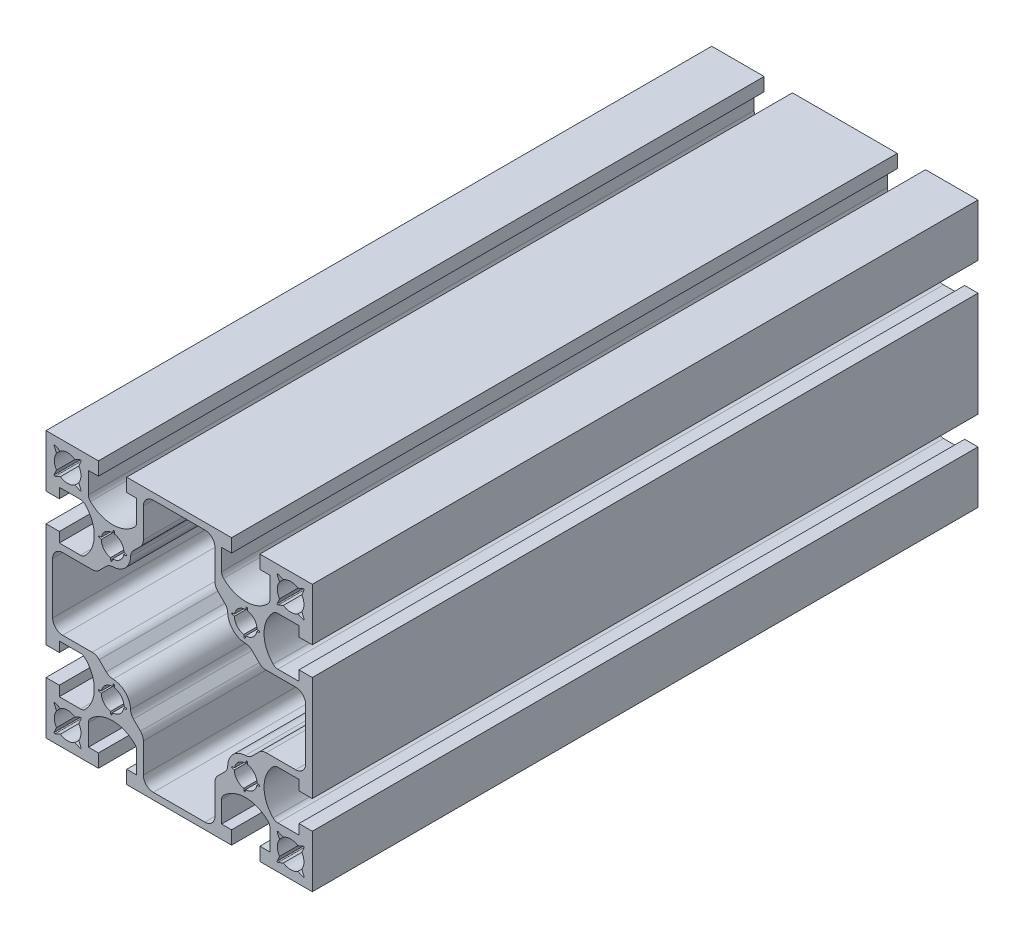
from build123d import *

# Parameters (mm, degrees)
SKETCH_1_W          = 80
SKETCH_1_H          = 80
EXTRUDE_1_DEPTH     = 100
SKETCH_2_R          = 4
SKETCH_2_R_2        = 3.4
CUT_EXTRUDE_1_DEPTH = 208.846096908
CUT_EXTRUDE_2_DEPTH = 208.846096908
CUT_EXTRUDE_3_DEPTH = 208.846096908
CUT_EXTRUDE_4_DEPTH = 208.846096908
CUT_EXTRUDE_5_DEPTH = 208.846096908


with BuildPart() as part:
    # Sketch 1 → Extrude 1 (new, symmetric)
    with BuildSketch(Plane.XY):
        Rectangle(SKETCH_1_W, SKETCH_1_H)
    extrude(amount=EXTRUDE_1_DEPTH, both=True)

    # Sketch 2 → Cut-Extrude 1 (cut, through all)
    with BuildSketch(Plane.XY.offset(100)):
        with Locations((-33.5, -33.5)):
            Circle(SKETCH_2_R)
        with Locations((-20, -20)):
            Circle(SKETCH_2_R_2)
        with Locations(Location((33.5, -33.5, 0), (0, 0, 180))):
            Circle(SKETCH_2_R)
        with Locations(Location((20, -20, 0), (0, 0, 180))):
            Circle(SKETCH_2_R_2)
        with Locations((33.5, 33.5)):
            Circle(SKETCH_2_R)
        with Locations((20, 20)):
            Circle(SKETCH_2_R_2)
        with Locations(Location((-20, 20, 0), (0, 0, 180))):
            Circle(SKETCH_2_R_2)
        with Locations(Location((-33.5, 33.5, 0), (0, 0, 180))):
            Circle(SKETCH_2_R)
    extrude(amount=-CUT_EXTRUDE_1_DEPTH, mode=Mode.SUBTRACT)

    # Sketch 3 → Cut-Extrude 2 (cut, through all)
    with BuildSketch(Plane.XY.offset(100)):
        with BuildLine():
            Line((-40, -15.75), (-40, -24.25))
            Line((-40, -24.25), (-36, -24.25))
            Line((-36, -24.25), (-36, -27.25))
            Line((-36, -27.25), (-29.643928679, -27.25))
            ThreePointArc((-29.643928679, -27.25), (-28.869332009, -27.093908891), (-28.215642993, -26.65))
            ThreePointArc((-28.215642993, -26.65), (-25.5, -20), (-28.215642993, -13.35))
            ThreePointArc((-28.215642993, -13.35), (-28.869332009, -12.906091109), (-29.643928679, -12.75))
            Line((-29.643928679, -12.75), (-36, -12.75))
            Line((-36, -12.75), (-36, -15.75))
            Line((-36, -15.75), (-40, -15.75))
        make_face()
        with BuildLine():
            Line((-12.75, -36), (-12.75, -29.643928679))
            ThreePointArc((-12.75, -29.643928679), (-12.906091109, -28.869332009), (-13.35, -28.215642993))
            ThreePointArc((-13.35, -28.215642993), (-20, -25.5), (-26.65, -28.215642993))
            ThreePointArc((-26.65, -28.215642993), (-27.093908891, -28.869332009), (-27.25, -29.643928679))
            Line((-27.25, -29.643928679), (-27.25, -36))
            Line((-27.25, -36), (-24.25, -36))
            Line((-24.25, -36), (-24.25, -40))
            Line((-24.25, -40), (-15.75, -40))
            Line((-15.75, -40), (-15.75, -36))
            Line((-15.75, -36), (-12.75, -36))
        make_face()
        with BuildLine():
            Line((-15.75, 40), (-24.25, 40))
            Line((-24.25, 40), (-24.25, 36))
            Line((-24.25, 36), (-27.25, 36))
            Line((-27.25, 36), (-27.25, 29.643928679))
            ThreePointArc((-27.25, 29.643928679), (-27.093908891, 28.869332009), (-26.65, 28.215642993))
            ThreePointArc((-26.65, 28.215642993), (-20, 25.5), (-13.35, 28.215642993))
            ThreePointArc((-13.35, 28.215642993), (-12.906091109, 28.869332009), (-12.75, 29.643928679))
            Line((-12.75, 29.643928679), (-12.75, 36))
            Line((-12.75, 36), (-15.75, 36))
            Line((-15.75, 36), (-15.75, 40))
        make_face()
        with BuildLine():
            Line((-36, 12.75), (-29.643928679, 12.75))
            ThreePointArc((-29.643928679, 12.75), (-28.869332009, 12.906091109), (-28.215642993, 13.35))
            ThreePointArc((-28.215642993, 13.35), (-25.5, 20), (-28.215642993, 26.65))
            ThreePointArc((-28.215642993, 26.65), (-28.869332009, 27.093908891), (-29.643928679, 27.25))
            Line((-29.643928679, 27.25), (-36, 27.25))
            Line((-36, 27.25), (-36, 24.25))
            Line((-36, 24.25), (-40, 24.25))
            Line((-40, 24.25), (-40, 15.75))
            Line((-40, 15.75), (-36, 15.75))
            Line((-36, 15.75), (-36, 12.75))
        make_face()
        with BuildLine():
            Line((40, 15.75), (40, 24.25))
            Line((40, 24.25), (36, 24.25))
            Line((36, 24.25), (36, 27.25))
            Line((36, 27.25), (29.643928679, 27.25))
            ThreePointArc((29.643928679, 27.25), (28.869332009, 27.093908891), (28.215642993, 26.65))
            ThreePointArc((28.215642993, 26.65), (25.5, 20), (28.215642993, 13.35))
            ThreePointArc((28.215642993, 13.35), (28.869332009, 12.906091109), (29.643928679, 12.75))
            Line((29.643928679, 12.75), (36, 12.75))
            Line((36, 12.75), (36, 15.75))
            Line((36, 15.75), (40, 15.75))
        make_face()
        with BuildLine():
            Line((12.75, 36), (12.75, 29.643928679))
            ThreePointArc((12.75, 29.643928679), (12.906091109, 28.869332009), (13.35, 28.215642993))
            ThreePointArc((13.35, 28.215642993), (20, 25.5), (26.65, 28.215642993))
            ThreePointArc((26.65, 28.215642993), (27.093908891, 28.869332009), (27.25, 29.643928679))
            Line((27.25, 29.643928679), (27.25, 36))
            Line((27.25, 36), (24.25, 36))
            Line((24.25, 36), (24.25, 40))
            Line((24.25, 40), (15.75, 40))
            Line((15.75, 40), (15.75, 36))
            Line((15.75, 36), (12.75, 36))
        make_face()
        with BuildLine():
            Line((15.75, -40), (24.25, -40))
            Line((24.25, -40), (24.25, -36))
            Line((24.25, -36), (27.25, -36))
            Line((27.25, -36), (27.25, -29.643928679))
            ThreePointArc((27.25, -29.643928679), (27.093908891, -28.869332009), (26.65, -28.215642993))
            ThreePointArc((26.65, -28.215642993), (20, -25.5), (13.35, -28.215642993))
            ThreePointArc((13.35, -28.215642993), (12.906091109, -28.869332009), (12.75, -29.643928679))
            Line((12.75, -29.643928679), (12.75, -36))
            Line((12.75, -36), (15.75, -36))
            Line((15.75, -36), (15.75, -40))
        make_face()
        with BuildLine():
            Line((36, -12.75), (29.643928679, -12.75))
            ThreePointArc((29.643928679, -12.75), (28.869332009, -12.906091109), (28.215642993, -13.35))
            ThreePointArc((28.215642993, -13.35), (25.5, -20), (28.215642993, -26.65))
            ThreePointArc((28.215642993, -26.65), (28.869332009, -27.093908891), (29.643928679, -27.25))
            Line((29.643928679, -27.25), (36, -27.25))
            Line((36, -27.25), (36, -24.25))
            Line((36, -24.25), (40, -24.25))
            Line((40, -24.25), (40, -15.75))
            Line((40, -15.75), (36, -15.75))
            Line((36, -15.75), (36, -12.75))
        make_face()
    extrude(amount=-CUT_EXTRUDE_2_DEPTH, mode=Mode.SUBTRACT)

    # Sketch 4 → Cut-Extrude 3 (cut, through all)
    with BuildSketch(Plane.XY.offset(100)):
        with BuildLine():
            Line((-38, 0), (-38, 7.75))
            ThreePointArc((-38, 7.75), (-37.121320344, 9.871320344), (-35, 10.75))
            Line((-35, 10.75), (-26.132912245, 10.75))
            ThreePointArc((-26.132912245, 10.75), (-24.984861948, 10.978361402), (-24.011591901, 11.628679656))
            Line((-24.011591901, 11.628679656), (-21.91645258, 13.723818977))
            ThreePointArc((-21.91645258, 13.723818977), (-20.976898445, 14.359930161), (-19.868299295, 14.601606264))
            ThreePointArc((-19.868299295, 14.601606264), (-16.181623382, 16.181623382), (-14.601606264, 19.868299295))
            ThreePointArc((-14.601606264, 19.868299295), (-14.359930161, 20.976898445), (-13.723818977, 21.91645258))
            Line((-13.723818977, 21.91645258), (-11.628679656, 24.011591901))
            ThreePointArc((-11.628679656, 24.011591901), (-10.978361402, 24.984861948), (-10.75, 26.132912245))
            Line((-10.75, 26.132912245), (-10.75, 35))
            ThreePointArc((-10.75, 35), (-9.871320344, 37.121320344), (-7.75, 38))
            Line((-7.75, 38), (0, 38))
            Line((0, 38), (7.75, 38))
            ThreePointArc((7.75, 38), (9.871320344, 37.121320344), (10.75, 35))
            Line((10.75, 35), (10.75, 26.132912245))
            ThreePointArc((10.75, 26.132912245), (10.978361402, 24.984861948), (11.628679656, 24.011591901))
            Line((11.628679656, 24.011591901), (13.723818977, 21.91645258))
            ThreePointArc((13.723818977, 21.91645258), (14.359930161, 20.976898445), (14.601606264, 19.868299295))
            ThreePointArc((14.601606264, 19.868299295), (16.181623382, 16.181623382), (19.868299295, 14.601606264))
            ThreePointArc((19.868299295, 14.601606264), (20.976898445, 14.359930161), (21.91645258, 13.723818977))
            Line((21.91645258, 13.723818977), (24.011591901, 11.628679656))
            ThreePointArc((24.011591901, 11.628679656), (24.984861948, 10.978361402), (26.132912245, 10.75))
            Line((26.132912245, 10.75), (35, 10.75))
            ThreePointArc((35, 10.75), (37.121320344, 9.871320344), (38, 7.75))
            Line((38, 7.75), (38, 0))
            Line((38, 0), (38, -7.75))
            ThreePointArc((38, -7.75), (37.121320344, -9.871320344), (35, -10.75))
            Line((35, -10.75), (26.132912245, -10.75))
            ThreePointArc((26.132912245, -10.75), (24.984861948, -10.978361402), (24.011591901, -11.628679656))
            Line((24.011591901, -11.628679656), (21.91645258, -13.723818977))
            ThreePointArc((21.91645258, -13.723818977), (20.976898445, -14.359930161), (19.868299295, -14.601606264))
            ThreePointArc((19.868299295, -14.601606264), (16.181623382, -16.181623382), (14.601606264, -19.868299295))
            ThreePointArc((14.601606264, -19.868299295), (14.359930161, -20.976898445), (13.723818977, -21.91645258))
            Line((13.723818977, -21.91645258), (11.628679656, -24.011591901))
            ThreePointArc((11.628679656, -24.011591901), (10.978361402, -24.984861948), (10.75, -26.132912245))
            Line((10.75, -26.132912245), (10.75, -35))
            ThreePointArc((10.75, -35), (9.871320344, -37.121320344), (7.75, -38))
            Line((7.75, -38), (0, -38))
            Line((0, -38), (-7.75, -38))
            ThreePointArc((-7.75, -38), (-9.871320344, -37.121320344), (-10.75, -35))
            Line((-10.75, -35), (-10.75, -26.132912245))
            ThreePointArc((-10.75, -26.132912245), (-10.978361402, -24.984861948), (-11.628679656, -24.011591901))
            Line((-11.628679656, -24.011591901), (-13.723818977, -21.91645258))
            ThreePointArc((-13.723818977, -21.91645258), (-14.359930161, -20.976898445), (-14.601606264, -19.868299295))
            ThreePointArc((-14.601606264, -19.868299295), (-16.181623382, -16.181623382), (-19.868299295, -14.601606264))
            ThreePointArc((-19.868299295, -14.601606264), (-20.976898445, -14.359930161), (-21.91645258, -13.723818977))
            Line((-21.91645258, -13.723818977), (-24.011591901, -11.628679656))
            ThreePointArc((-24.011591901, -11.628679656), (-24.984861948, -10.978361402), (-26.132912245, -10.75))
            Line((-26.132912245, -10.75), (-35, -10.75))
            ThreePointArc((-35, -10.75), (-37.121320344, -9.871320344), (-38, -7.75))
            Line((-38, -7.75), (-38, 0))
        make_face()
    extrude(amount=-CUT_EXTRUDE_3_DEPTH, mode=Mode.SUBTRACT)

    # Sketch 5 → Cut-Extrude 4 (cut, through all)
    with BuildSketch(Plane.XY.offset(100)):
        with BuildLine():
            Line((-16.6, -20), (-15.942283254, -20.156380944))
            ThreePointArc((-15.942283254, -20.156380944), (-15.789307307, -20.368387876), (-15.976773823, -20.550609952))
            Line((-15.976773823, -20.550609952), (-16.65165364, -20.590403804))
            ThreePointArc((-16.65165364, -20.590403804), (-16.612938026, -20.296329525), (-16.6, -20))
        make_face()
        with BuildLine():
            Line((-20, -23.4), (-20.156380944, -24.057716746))
            ThreePointArc((-20.156380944, -24.057716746), (-20.368387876, -24.210692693), (-20.550609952, -24.023226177))
            Line((-20.550609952, -24.023226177), (-20.590403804, -23.34834636))
            ThreePointArc((-20.590403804, -23.34834636), (-20.296329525, -23.387061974), (-20, -23.4))
        make_face()
        with BuildLine():
            Line((-23.4, -20), (-24.057716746, -19.843619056))
            ThreePointArc((-24.057716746, -19.843619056), (-24.210692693, -19.631612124), (-24.023226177, -19.449390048))
            Line((-24.023226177, -19.449390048), (-23.34834636, -19.409596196))
            ThreePointArc((-23.34834636, -19.409596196), (-23.387061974, -19.703670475), (-23.4, -20))
        make_face()
        with BuildLine():
            Line((-20, -16.6), (-19.843619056, -15.942283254))
            ThreePointArc((-19.843619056, -15.942283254), (-19.631612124, -15.789307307), (-19.449390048, -15.976773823))
            Line((-19.449390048, -15.976773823), (-19.409596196, -16.65165364))
            ThreePointArc((-19.409596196, -16.65165364), (-19.703670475, -16.612938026), (-20, -16.6))
        make_face()
        with BuildLine():
            Line((-20, 16.6), (-20.156380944, 15.942283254))
            ThreePointArc((-20.156380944, 15.942283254), (-20.368387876, 15.789307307), (-20.550609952, 15.976773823))
            Line((-20.550609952, 15.976773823), (-20.590403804, 16.65165364))
            ThreePointArc((-20.590403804, 16.65165364), (-20.296329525, 16.612938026), (-20, 16.6))
        make_face()
        with BuildLine():
            Line((-23.4, 20), (-24.057716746, 20.156380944))
            ThreePointArc((-24.057716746, 20.156380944), (-24.210692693, 20.368387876), (-24.023226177, 20.550609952))
            Line((-24.023226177, 20.550609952), (-23.34834636, 20.590403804))
            ThreePointArc((-23.34834636, 20.590403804), (-23.387061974, 20.296329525), (-23.4, 20))
        make_face()
        with BuildLine():
            Line((-20, 23.4), (-19.843619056, 24.057716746))
            ThreePointArc((-19.843619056, 24.057716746), (-19.631612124, 24.210692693), (-19.449390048, 24.023226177))
            Line((-19.449390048, 24.023226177), (-19.409596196, 23.34834636))
            ThreePointArc((-19.409596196, 23.34834636), (-19.703670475, 23.387061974), (-20, 23.4))
        make_face()
        with BuildLine():
            Line((-16.6, 20), (-15.942283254, 19.843619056))
            ThreePointArc((-15.942283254, 19.843619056), (-15.789307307, 19.631612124), (-15.976773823, 19.449390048))
            Line((-15.976773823, 19.449390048), (-16.65165364, 19.409596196))
            ThreePointArc((-16.65165364, 19.409596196), (-16.612938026, 19.703670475), (-16.6, 20))
        make_face()
        with BuildLine():
            Line((16.6, 20), (15.942283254, 20.156380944))
            ThreePointArc((15.942283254, 20.156380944), (15.789307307, 20.368387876), (15.976773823, 20.550609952))
            Line((15.976773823, 20.550609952), (16.65165364, 20.590403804))
            ThreePointArc((16.65165364, 20.590403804), (16.612938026, 20.296329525), (16.6, 20))
        make_face()
        with BuildLine():
            Line((20, 23.4), (20.156380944, 24.057716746))
            ThreePointArc((20.156380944, 24.057716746), (20.368387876, 24.210692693), (20.550609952, 24.023226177))
            Line((20.550609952, 24.023226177), (20.590403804, 23.34834636))
            ThreePointArc((20.590403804, 23.34834636), (20.296329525, 23.387061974), (20, 23.4))
        make_face()
        with BuildLine():
            Line((23.4, 20), (24.057716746, 19.843619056))
            ThreePointArc((24.057716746, 19.843619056), (24.210692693, 19.631612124), (24.023226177, 19.449390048))
            Line((24.023226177, 19.449390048), (23.34834636, 19.409596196))
            ThreePointArc((23.34834636, 19.409596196), (23.387061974, 19.703670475), (23.4, 20))
        make_face()
        with BuildLine():
            Line((20, 16.6), (19.843619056, 15.942283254))
            ThreePointArc((19.843619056, 15.942283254), (19.631612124, 15.789307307), (19.449390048, 15.976773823))
            Line((19.449390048, 15.976773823), (19.409596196, 16.65165364))
            ThreePointArc((19.409596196, 16.65165364), (19.703670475, 16.612938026), (20, 16.6))
        make_face()
        with BuildLine():
            Line((20, -16.6), (20.156380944, -15.942283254))
            ThreePointArc((20.156380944, -15.942283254), (20.368387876, -15.789307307), (20.550609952, -15.976773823))
            Line((20.550609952, -15.976773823), (20.590403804, -16.65165364))
            ThreePointArc((20.590403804, -16.65165364), (20.296329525, -16.612938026), (20, -16.6))
        make_face()
        with BuildLine():
            Line((23.4, -20), (24.057716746, -20.156380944))
            ThreePointArc((24.057716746, -20.156380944), (24.210692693, -20.368387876), (24.023226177, -20.550609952))
            Line((24.023226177, -20.550609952), (23.34834636, -20.590403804))
            ThreePointArc((23.34834636, -20.590403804), (23.387061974, -20.296329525), (23.4, -20))
        make_face()
        with BuildLine():
            Line((20, -23.4), (19.843619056, -24.057716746))
            ThreePointArc((19.843619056, -24.057716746), (19.631612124, -24.210692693), (19.449390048, -24.023226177))
            Line((19.449390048, -24.023226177), (19.409596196, -23.34834636))
            ThreePointArc((19.409596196, -23.34834636), (19.703670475, -23.387061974), (20, -23.4))
        make_face()
        with BuildLine():
            Line((16.6, -20), (15.942283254, -19.843619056))
            ThreePointArc((15.942283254, -19.843619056), (15.789307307, -19.631612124), (15.976773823, -19.449390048))
            Line((15.976773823, -19.449390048), (16.65165364, -19.409596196))
            ThreePointArc((16.65165364, -19.409596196), (16.612938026, -19.703670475), (16.6, -20))
        make_face()
    extrude(amount=-CUT_EXTRUDE_4_DEPTH, mode=Mode.SUBTRACT)

    # Sketch 6 → Cut-Extrude 5 (cut, through all)
    with BuildSketch(Plane.XY.offset(100)):
        with BuildLine():
            Line((-29.72726305, -29.463724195), (-31.304492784, -30.156386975))
            ThreePointArc((-31.304492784, -30.156386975), (-30.671572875, -30.671572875), (-30.156386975, -31.304492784))
            Line((-30.156386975, -31.304492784), (-29.463724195, -29.72726305))
            ThreePointArc((-29.463724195, -29.72726305), (-29.505422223, -29.505422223), (-29.72726305, -29.463724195))
        make_face()
        with BuildLine():
            Line((-29.463724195, -37.27273695), (-30.156386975, -35.695507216))
            ThreePointArc((-30.156386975, -35.695507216), (-30.671572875, -36.328427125), (-31.304492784, -36.843613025))
            Line((-31.304492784, -36.843613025), (-29.72726305, -37.536275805))
            ThreePointArc((-29.72726305, -37.536275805), (-29.505422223, -37.494577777), (-29.463724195, -37.27273695))
        make_face()
        with BuildLine():
            Line((-37.27273695, -37.536275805), (-35.695507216, -36.843613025))
            ThreePointArc((-35.695507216, -36.843613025), (-36.328427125, -36.328427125), (-36.843613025, -35.695507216))
            Line((-36.843613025, -35.695507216), (-37.536275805, -37.27273695))
            ThreePointArc((-37.536275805, -37.27273695), (-37.494577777, -37.494577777), (-37.27273695, -37.536275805))
        make_face()
        with BuildLine():
            Line((-37.536275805, -29.72726305), (-36.843613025, -31.304492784))
            ThreePointArc((-36.843613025, -31.304492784), (-36.328427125, -30.671572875), (-35.695507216, -30.156386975))
            Line((-35.695507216, -30.156386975), (-37.27273695, -29.463724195))
            ThreePointArc((-37.27273695, -29.463724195), (-37.494577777, -29.505422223), (-37.536275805, -29.72726305))
        make_face()
        with BuildLine():
            Line((-29.463724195, 29.72726305), (-30.156386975, 31.304492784))
            ThreePointArc((-30.156386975, 31.304492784), (-30.671572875, 30.671572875), (-31.304492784, 30.156386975))
            Line((-31.304492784, 30.156386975), (-29.72726305, 29.463724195))
            ThreePointArc((-29.72726305, 29.463724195), (-29.505422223, 29.505422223), (-29.463724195, 29.72726305))
        make_face()
        with BuildLine():
            Line((-37.27273695, 29.463724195), (-35.695507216, 30.156386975))
            ThreePointArc((-35.695507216, 30.156386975), (-36.328427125, 30.671572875), (-36.843613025, 31.304492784))
            Line((-36.843613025, 31.304492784), (-37.536275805, 29.72726305))
            ThreePointArc((-37.536275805, 29.72726305), (-37.494577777, 29.505422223), (-37.27273695, 29.463724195))
        make_face()
        with BuildLine():
            Line((-37.536275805, 37.27273695), (-36.843613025, 35.695507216))
            ThreePointArc((-36.843613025, 35.695507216), (-36.328427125, 36.328427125), (-35.695507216, 36.843613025))
            Line((-35.695507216, 36.843613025), (-37.27273695, 37.536275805))
            ThreePointArc((-37.27273695, 37.536275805), (-37.494577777, 37.494577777), (-37.536275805, 37.27273695))
        make_face()
        with BuildLine():
            Line((-29.72726305, 37.536275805), (-31.304492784, 36.843613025))
            ThreePointArc((-31.304492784, 36.843613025), (-30.671572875, 36.328427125), (-30.156386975, 35.695507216))
            Line((-30.156386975, 35.695507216), (-29.463724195, 37.27273695))
            ThreePointArc((-29.463724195, 37.27273695), (-29.505422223, 37.494577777), (-29.72726305, 37.536275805))
        make_face()
        with BuildLine():
            Line((29.72726305, 29.463724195), (31.304492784, 30.156386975))
            ThreePointArc((31.304492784, 30.156386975), (30.671572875, 30.671572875), (30.156386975, 31.304492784))
            Line((30.156386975, 31.304492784), (29.463724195, 29.72726305))
            ThreePointArc((29.463724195, 29.72726305), (29.505422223, 29.505422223), (29.72726305, 29.463724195))
        make_face()
        with BuildLine():
            Line((29.463724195, 37.27273695), (30.156386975, 35.695507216))
            ThreePointArc((30.156386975, 35.695507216), (30.671572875, 36.328427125), (31.304492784, 36.843613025))
            Line((31.304492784, 36.843613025), (29.72726305, 37.536275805))
            ThreePointArc((29.72726305, 37.536275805), (29.505422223, 37.494577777), (29.463724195, 37.27273695))
        make_face()
        with BuildLine():
            Line((37.27273695, 37.536275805), (35.695507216, 36.843613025))
            ThreePointArc((35.695507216, 36.843613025), (36.328427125, 36.328427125), (36.843613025, 35.695507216))
            Line((36.843613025, 35.695507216), (37.536275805, 37.27273695))
            ThreePointArc((37.536275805, 37.27273695), (37.494577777, 37.494577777), (37.27273695, 37.536275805))
        make_face()
        with BuildLine():
            Line((37.536275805, 29.72726305), (36.843613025, 31.304492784))
            ThreePointArc((36.843613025, 31.304492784), (36.328427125, 30.671572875), (35.695507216, 30.156386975))
            Line((35.695507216, 30.156386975), (37.27273695, 29.463724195))
            ThreePointArc((37.27273695, 29.463724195), (37.494577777, 29.505422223), (37.536275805, 29.72726305))
        make_face()
        with BuildLine():
            Line((29.463724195, -29.72726305), (30.156386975, -31.304492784))
            ThreePointArc((30.156386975, -31.304492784), (30.671572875, -30.671572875), (31.304492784, -30.156386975))
            Line((31.304492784, -30.156386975), (29.72726305, -29.463724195))
            ThreePointArc((29.72726305, -29.463724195), (29.505422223, -29.505422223), (29.463724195, -29.72726305))
        make_face()
        with BuildLine():
            Line((37.27273695, -29.463724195), (35.695507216, -30.156386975))
            ThreePointArc((35.695507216, -30.156386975), (36.328427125, -30.671572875), (36.843613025, -31.304492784))
            Line((36.843613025, -31.304492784), (37.536275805, -29.72726305))
            ThreePointArc((37.536275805, -29.72726305), (37.494577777, -29.505422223), (37.27273695, -29.463724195))
        make_face()
        with BuildLine():
            Line((37.536275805, -37.27273695), (36.843613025, -35.695507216))
            ThreePointArc((36.843613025, -35.695507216), (36.328427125, -36.328427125), (35.695507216, -36.843613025))
            Line((35.695507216, -36.843613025), (37.27273695, -37.536275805))
            ThreePointArc((37.27273695, -37.536275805), (37.494577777, -37.494577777), (37.536275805, -37.27273695))
        make_face()
        with BuildLine():
            Line((29.72726305, -37.536275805), (31.304492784, -36.843613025))
            ThreePointArc((31.304492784, -36.843613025), (30.671572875, -36.328427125), (30.156386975, -35.695507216))
            Line((30.156386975, -35.695507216), (29.463724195, -37.27273695))
            ThreePointArc((29.463724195, -37.27273695), (29.505422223, -37.494577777), (29.72726305, -37.536275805))
        make_face()
    extrude(amount=-CUT_EXTRUDE_5_DEPTH, mode=Mode.SUBTRACT)


solid = part.part
